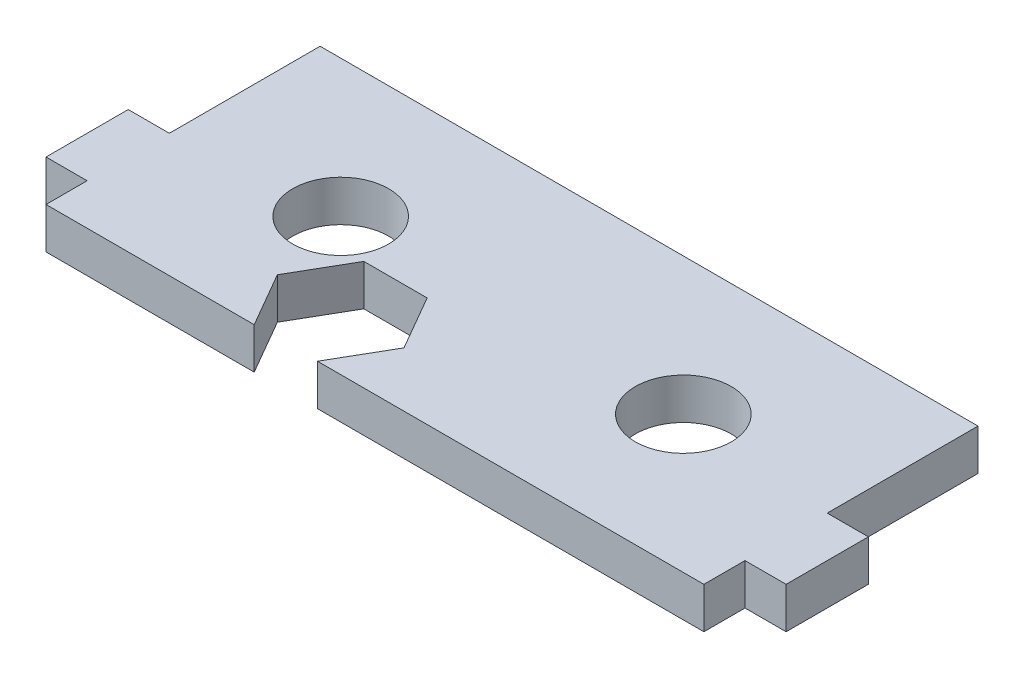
ISO-10303-21;
HEADER;
FILE_DESCRIPTION(('STEP AP214'),'2;1');
FILE_NAME('part.step','',(''),(''),'','','');
FILE_SCHEMA(('AUTOMOTIVE_DESIGN { 1 0 10303 214 1 1 1 1 }'));
ENDSEC;
DATA;
#1=APPLICATION_CONTEXT('core data for automotive mechanical design processes');
#2=APPLICATION_PROTOCOL_DEFINITION('international standard','automotive_design',2000,#1);
#3=PRODUCT_CONTEXT('',#1,'mechanical');
#4=PRODUCT('Part','Part','',(#3));
#5=PRODUCT_RELATED_PRODUCT_CATEGORY('part','',(#4));
#6=PRODUCT_DEFINITION_FORMATION('','',#4);
#7=PRODUCT_DEFINITION_CONTEXT('part definition',#1,'design');
#8=PRODUCT_DEFINITION('design','',#6,#7);
#9=PRODUCT_DEFINITION_SHAPE('','',#8);
#10=(LENGTH_UNIT() NAMED_UNIT(*) SI_UNIT(.MILLI.,.METRE.));
#11=(NAMED_UNIT(*) PLANE_ANGLE_UNIT() SI_UNIT($,.RADIAN.));
#12=(NAMED_UNIT(*) SI_UNIT($,.STERADIAN.) SOLID_ANGLE_UNIT());
#13=UNCERTAINTY_MEASURE_WITH_UNIT(LENGTH_MEASURE(1.E-05),#10,'distance_accuracy_value','');
#14=(GEOMETRIC_REPRESENTATION_CONTEXT(3) GLOBAL_UNCERTAINTY_ASSIGNED_CONTEXT((#13)) GLOBAL_UNIT_ASSIGNED_CONTEXT((#10,
#11,#12)) REPRESENTATION_CONTEXT('',''));
#15=CARTESIAN_POINT('',(0.,0.,0.));
#16=DIRECTION('',(0.,0.,1.));
#17=DIRECTION('',(1.,0.,0.));
#18=AXIS2_PLACEMENT_3D('',#15,#16,#17);
#19=CARTESIAN_POINT('',(24.,3.,10.));
#20=DIRECTION('',(0.,1.,0.));
#21=DIRECTION('',(0.,0.,1.));
#22=AXIS2_PLACEMENT_3D('',#19,#20,#21);
#23=PLANE('',#22);
#24=CARTESIAN_POINT('',(-12.5,3.,0.));
#25=DIRECTION('',(0.,1.,0.));
#26=DIRECTION('',(0.,0.,1.));
#27=AXIS2_PLACEMENT_3D('',#24,#25,#26);
#28=CIRCLE('',#27,3.5);
#29=CARTESIAN_POINT('',(-12.5,3.,3.5));
#30=VERTEX_POINT('',#29);
#31=EDGE_CURVE('E194',#30,#30,#28,.T.);
#32=ORIENTED_EDGE('',*,*,#31,.F.);
#33=EDGE_LOOP('',(#32));
#34=FACE_BOUND('',#33,.T.);
#35=DIRECTION('',(1.,0.,0.));
#36=VECTOR('',#35,1.);
#37=CARTESIAN_POINT('',(-24.,3.,10.));
#38=LINE('',#37,#36);
#39=CARTESIAN_POINT('',(-24.,3.,10.));
#40=VERTEX_POINT('',#39);
#41=CARTESIAN_POINT('',(-8.80940107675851,3.,10.));
#42=VERTEX_POINT('',#41);
#43=EDGE_CURVE('E279',#40,#42,#38,.T.);
#44=ORIENTED_EDGE('',*,*,#43,.T.);
#45=DIRECTION('',(0.5,0.,0.866025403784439));
#46=VECTOR('',#45,1.);
#47=CARTESIAN_POINT('',(-11.118802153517,3.,6.));
#48=LINE('',#47,#46);
#49=CARTESIAN_POINT('',(-11.118802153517,3.,6.));
#50=VERTEX_POINT('',#49);
#51=EDGE_CURVE('E186',#50,#42,#48,.T.);
#52=ORIENTED_EDGE('',*,*,#51,.F.);
#53=DIRECTION('',(-0.5,0.,0.866025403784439));
#54=VECTOR('',#53,1.);
#55=CARTESIAN_POINT('',(-8.80940107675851,3.,1.99999999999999));
#56=LINE('',#55,#54);
#57=CARTESIAN_POINT('',(-8.80940107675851,3.,1.99999999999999));
#58=VERTEX_POINT('',#57);
#59=EDGE_CURVE('E184',#58,#50,#56,.T.);
#60=ORIENTED_EDGE('',*,*,#59,.F.);
#61=DIRECTION('',(-1.,0.,0.));
#62=VECTOR('',#61,1.);
#63=CARTESIAN_POINT('',(-4.19059892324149,3.,1.99999999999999));
#64=LINE('',#63,#62);
#65=CARTESIAN_POINT('',(-4.19059892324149,3.,1.99999999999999));
#66=VERTEX_POINT('',#65);
#67=EDGE_CURVE('E170',#66,#58,#64,.T.);
#68=ORIENTED_EDGE('',*,*,#67,.F.);
#69=DIRECTION('',(-0.5,0.,-0.866025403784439));
#70=VECTOR('',#69,1.);
#71=CARTESIAN_POINT('',(-1.88119784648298,3.,6.));
#72=LINE('',#71,#70);
#73=CARTESIAN_POINT('',(-1.88119784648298,3.,6.));
#74=VERTEX_POINT('',#73);
#75=EDGE_CURVE('E162',#74,#66,#72,.T.);
#76=ORIENTED_EDGE('',*,*,#75,.F.);
#77=DIRECTION('',(0.5,0.,-0.866025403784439));
#78=VECTOR('',#77,1.);
#79=CARTESIAN_POINT('',(-4.19059892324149,3.,10.));
#80=LINE('',#79,#78);
#81=CARTESIAN_POINT('',(-4.19059892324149,3.,10.));
#82=VERTEX_POINT('',#81);
#83=EDGE_CURVE('E191',#82,#74,#80,.T.);
#84=ORIENTED_EDGE('',*,*,#83,.F.);
#85=CARTESIAN_POINT('',(24.,3.,10.));
#86=VERTEX_POINT('',#85);
#87=EDGE_CURVE('E292',#82,#86,#38,.T.);
#88=ORIENTED_EDGE('',*,*,#87,.T.);
#89=DIRECTION('',(0.,0.,-1.));
#90=VECTOR('',#89,1.);
#91=CARTESIAN_POINT('',(24.,3.,-9.99999999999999));
#92=LINE('',#91,#90);
#93=CARTESIAN_POINT('',(24.,3.,7.00000000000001));
#94=VERTEX_POINT('',#93);
#95=EDGE_CURVE('E259',#86,#94,#92,.T.);
#96=ORIENTED_EDGE('',*,*,#95,.T.);
#97=DIRECTION('',(1.,0.,0.));
#98=VECTOR('',#97,1.);
#99=CARTESIAN_POINT('',(27.,3.,7.00000000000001));
#100=LINE('',#99,#98);
#101=CARTESIAN_POINT('',(27.,3.,7.00000000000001));
#102=VERTEX_POINT('',#101);
#103=EDGE_CURVE('E216',#94,#102,#100,.T.);
#104=ORIENTED_EDGE('',*,*,#103,.T.);
#105=DIRECTION('',(0.,0.,-1.));
#106=VECTOR('',#105,1.);
#107=CARTESIAN_POINT('',(27.,3.,1.00000000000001));
#108=LINE('',#107,#106);
#109=CARTESIAN_POINT('',(27.,3.,1.00000000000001));
#110=VERTEX_POINT('',#109);
#111=EDGE_CURVE('E213',#102,#110,#108,.T.);
#112=ORIENTED_EDGE('',*,*,#111,.T.);
#113=DIRECTION('',(-1.,0.,0.));
#114=VECTOR('',#113,1.);
#115=CARTESIAN_POINT('',(27.,3.,1.00000000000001));
#116=LINE('',#115,#114);
#117=CARTESIAN_POINT('',(24.,3.,1.00000000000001));
#118=VERTEX_POINT('',#117);
#119=EDGE_CURVE('E219',#110,#118,#116,.T.);
#120=ORIENTED_EDGE('',*,*,#119,.T.);
#121=CARTESIAN_POINT('',(24.,3.,-9.99999999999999));
#122=VERTEX_POINT('',#121);
#123=EDGE_CURVE('E244',#118,#122,#92,.T.);
#124=ORIENTED_EDGE('',*,*,#123,.T.);
#125=DIRECTION('',(-1.,0.,0.));
#126=VECTOR('',#125,1.);
#127=CARTESIAN_POINT('',(-24.,3.,-9.99999999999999));
#128=LINE('',#127,#126);
#129=CARTESIAN_POINT('',(-24.,3.,-9.99999999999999));
#130=VERTEX_POINT('',#129);
#131=EDGE_CURVE('E262',#122,#130,#128,.T.);
#132=ORIENTED_EDGE('',*,*,#131,.T.);
#133=DIRECTION('',(0.,0.,1.));
#134=VECTOR('',#133,1.);
#135=CARTESIAN_POINT('',(-24.,3.,-9.99999999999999));
#136=LINE('',#135,#134);
#137=CARTESIAN_POINT('',(-24.,3.,1.00000000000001));
#138=VERTEX_POINT('',#137);
#139=EDGE_CURVE('E288',#130,#138,#136,.T.);
#140=ORIENTED_EDGE('',*,*,#139,.T.);
#141=DIRECTION('',(-1.,0.,0.));
#142=VECTOR('',#141,1.);
#143=CARTESIAN_POINT('',(-27.,3.,1.00000000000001));
#144=LINE('',#143,#142);
#145=CARTESIAN_POINT('',(-27.,3.,1.00000000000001));
#146=VERTEX_POINT('',#145);
#147=EDGE_CURVE('E336',#138,#146,#144,.T.);
#148=ORIENTED_EDGE('',*,*,#147,.T.);
#149=DIRECTION('',(0.,0.,1.));
#150=VECTOR('',#149,1.);
#151=CARTESIAN_POINT('',(-27.,3.,1.00000000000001));
#152=LINE('',#151,#150);
#153=CARTESIAN_POINT('',(-27.,3.,7.00000000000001));
#154=VERTEX_POINT('',#153);
#155=EDGE_CURVE('E340',#146,#154,#152,.T.);
#156=ORIENTED_EDGE('',*,*,#155,.T.);
#157=DIRECTION('',(1.,0.,0.));
#158=VECTOR('',#157,1.);
#159=CARTESIAN_POINT('',(-27.,3.,7.00000000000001));
#160=LINE('',#159,#158);
#161=CARTESIAN_POINT('',(-24.,3.,7.00000000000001));
#162=VERTEX_POINT('',#161);
#163=EDGE_CURVE('E333',#154,#162,#160,.T.);
#164=ORIENTED_EDGE('',*,*,#163,.T.);
#165=EDGE_CURVE('E293',#162,#40,#136,.T.);
#166=ORIENTED_EDGE('',*,*,#165,.T.);
#167=EDGE_LOOP('',(#44,#52,#60,#68,#76,#84,#88,#96,#104,#112,#120,#124,#132,#140,#148,#156,#164,#166));
#168=FACE_BOUND('',#167,.T.);
#169=CARTESIAN_POINT('',(12.5,3.,0.));
#170=DIRECTION('',(0.,1.,0.));
#171=DIRECTION('',(0.,0.,1.));
#172=AXIS2_PLACEMENT_3D('',#169,#170,#171);
#173=CIRCLE('',#172,3.5);
#174=CARTESIAN_POINT('',(12.5,3.,3.5));
#175=VERTEX_POINT('',#174);
#176=EDGE_CURVE('E588',#175,#175,#173,.T.);
#177=ORIENTED_EDGE('',*,*,#176,.F.);
#178=EDGE_LOOP('',(#177));
#179=FACE_BOUND('',#178,.T.);
#180=ADVANCED_FACE('F33',(#34,#168,#179),#23,.T.);
#181=CARTESIAN_POINT('',(24.,0.,10.));
#182=DIRECTION('',(0.,1.,0.));
#183=DIRECTION('',(0.,0.,1.));
#184=AXIS2_PLACEMENT_3D('',#181,#182,#183);
#185=PLANE('',#184);
#186=CARTESIAN_POINT('',(-12.5,0.,0.));
#187=DIRECTION('',(0.,1.,0.));
#188=DIRECTION('',(0.,0.,1.));
#189=AXIS2_PLACEMENT_3D('',#186,#187,#188);
#190=CIRCLE('',#189,3.5);
#191=CARTESIAN_POINT('',(-12.5,0.,3.5));
#192=VERTEX_POINT('',#191);
#193=EDGE_CURVE('E593',#192,#192,#190,.T.);
#194=ORIENTED_EDGE('',*,*,#193,.T.);
#195=EDGE_LOOP('',(#194));
#196=FACE_BOUND('',#195,.T.);
#197=DIRECTION('',(0.5,0.,0.866025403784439));
#198=VECTOR('',#197,1.);
#199=CARTESIAN_POINT('',(-11.118802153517,0.,6.));
#200=LINE('',#199,#198);
#201=CARTESIAN_POINT('',(-11.118802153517,0.,6.));
#202=VERTEX_POINT('',#201);
#203=CARTESIAN_POINT('',(-8.80940107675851,0.,10.));
#204=VERTEX_POINT('',#203);
#205=EDGE_CURVE('E199',#202,#204,#200,.T.);
#206=ORIENTED_EDGE('',*,*,#205,.T.);
#207=DIRECTION('',(1.,0.,0.));
#208=VECTOR('',#207,1.);
#209=CARTESIAN_POINT('',(-24.,0.,10.));
#210=LINE('',#209,#208);
#211=CARTESIAN_POINT('',(-24.,0.,10.));
#212=VERTEX_POINT('',#211);
#213=EDGE_CURVE('E260',#212,#204,#210,.T.);
#214=ORIENTED_EDGE('',*,*,#213,.F.);
#215=DIRECTION('',(0.,0.,1.));
#216=VECTOR('',#215,1.);
#217=CARTESIAN_POINT('',(-24.,0.,-9.99999999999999));
#218=LINE('',#217,#216);
#219=CARTESIAN_POINT('',(-24.,0.,7.00000000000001));
#220=VERTEX_POINT('',#219);
#221=EDGE_CURVE('E285',#220,#212,#218,.T.);
#222=ORIENTED_EDGE('',*,*,#221,.F.);
#223=DIRECTION('',(1.,0.,0.));
#224=VECTOR('',#223,1.);
#225=CARTESIAN_POINT('',(-27.,0.,7.00000000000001));
#226=LINE('',#225,#224);
#227=CARTESIAN_POINT('',(-27.,0.,7.00000000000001));
#228=VERTEX_POINT('',#227);
#229=EDGE_CURVE('E334',#228,#220,#226,.T.);
#230=ORIENTED_EDGE('',*,*,#229,.F.);
#231=DIRECTION('',(0.,0.,1.));
#232=VECTOR('',#231,1.);
#233=CARTESIAN_POINT('',(-27.,0.,1.00000000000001));
#234=LINE('',#233,#232);
#235=CARTESIAN_POINT('',(-27.,0.,1.00000000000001));
#236=VERTEX_POINT('',#235);
#237=EDGE_CURVE('E311',#236,#228,#234,.T.);
#238=ORIENTED_EDGE('',*,*,#237,.F.);
#239=DIRECTION('',(-1.,0.,0.));
#240=VECTOR('',#239,1.);
#241=CARTESIAN_POINT('',(-27.,0.,1.00000000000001));
#242=LINE('',#241,#240);
#243=CARTESIAN_POINT('',(-24.,0.,1.00000000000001));
#244=VERTEX_POINT('',#243);
#245=EDGE_CURVE('E249',#244,#236,#242,.T.);
#246=ORIENTED_EDGE('',*,*,#245,.F.);
#247=CARTESIAN_POINT('',(-24.,0.,-9.99999999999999));
#248=VERTEX_POINT('',#247);
#249=EDGE_CURVE('E270',#248,#244,#218,.T.);
#250=ORIENTED_EDGE('',*,*,#249,.F.);
#251=DIRECTION('',(-1.,0.,0.));
#252=VECTOR('',#251,1.);
#253=CARTESIAN_POINT('',(-24.,0.,-9.99999999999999));
#254=LINE('',#253,#252);
#255=CARTESIAN_POINT('',(24.,0.,-9.99999999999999));
#256=VERTEX_POINT('',#255);
#257=EDGE_CURVE('E287',#256,#248,#254,.T.);
#258=ORIENTED_EDGE('',*,*,#257,.F.);
#259=DIRECTION('',(0.,0.,-1.));
#260=VECTOR('',#259,1.);
#261=CARTESIAN_POINT('',(24.,0.,-9.99999999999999));
#262=LINE('',#261,#260);
#263=CARTESIAN_POINT('',(24.,0.,1.00000000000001));
#264=VERTEX_POINT('',#263);
#265=EDGE_CURVE('E303',#264,#256,#262,.T.);
#266=ORIENTED_EDGE('',*,*,#265,.F.);
#267=DIRECTION('',(-1.,0.,0.));
#268=VECTOR('',#267,1.);
#269=CARTESIAN_POINT('',(27.,0.,1.00000000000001));
#270=LINE('',#269,#268);
#271=CARTESIAN_POINT('',(27.,0.,1.00000000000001));
#272=VERTEX_POINT('',#271);
#273=EDGE_CURVE('E58',#272,#264,#270,.T.);
#274=ORIENTED_EDGE('',*,*,#273,.F.);
#275=DIRECTION('',(0.,0.,-1.));
#276=VECTOR('',#275,1.);
#277=CARTESIAN_POINT('',(27.,0.,1.00000000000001));
#278=LINE('',#277,#276);
#279=CARTESIAN_POINT('',(27.,0.,7.00000000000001));
#280=VERTEX_POINT('',#279);
#281=EDGE_CURVE('E217',#280,#272,#278,.T.);
#282=ORIENTED_EDGE('',*,*,#281,.F.);
#283=DIRECTION('',(1.,0.,0.));
#284=VECTOR('',#283,1.);
#285=CARTESIAN_POINT('',(27.,0.,7.00000000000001));
#286=LINE('',#285,#284);
#287=CARTESIAN_POINT('',(24.,0.,7.00000000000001));
#288=VERTEX_POINT('',#287);
#289=EDGE_CURVE('E220',#288,#280,#286,.T.);
#290=ORIENTED_EDGE('',*,*,#289,.F.);
#291=CARTESIAN_POINT('',(24.,0.,10.));
#292=VERTEX_POINT('',#291);
#293=EDGE_CURVE('E305',#292,#288,#262,.T.);
#294=ORIENTED_EDGE('',*,*,#293,.F.);
#295=CARTESIAN_POINT('',(-4.19059892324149,0.,10.));
#296=VERTEX_POINT('',#295);
#297=EDGE_CURVE('E264',#296,#292,#210,.T.);
#298=ORIENTED_EDGE('',*,*,#297,.F.);
#299=DIRECTION('',(0.5,0.,-0.866025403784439));
#300=VECTOR('',#299,1.);
#301=CARTESIAN_POINT('',(-4.19059892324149,0.,10.));
#302=LINE('',#301,#300);
#303=CARTESIAN_POINT('',(-1.88119784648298,0.,6.));
#304=VERTEX_POINT('',#303);
#305=EDGE_CURVE('E171',#296,#304,#302,.T.);
#306=ORIENTED_EDGE('',*,*,#305,.T.);
#307=DIRECTION('',(-0.5,0.,-0.866025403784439));
#308=VECTOR('',#307,1.);
#309=CARTESIAN_POINT('',(-1.88119784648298,0.,6.));
#310=LINE('',#309,#308);
#311=CARTESIAN_POINT('',(-4.19059892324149,0.,1.99999999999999));
#312=VERTEX_POINT('',#311);
#313=EDGE_CURVE('E50',#304,#312,#310,.T.);
#314=ORIENTED_EDGE('',*,*,#313,.T.);
#315=DIRECTION('',(-1.,0.,0.));
#316=VECTOR('',#315,1.);
#317=CARTESIAN_POINT('',(-4.19059892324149,0.,1.99999999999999));
#318=LINE('',#317,#316);
#319=CARTESIAN_POINT('',(-8.80940107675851,0.,1.99999999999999));
#320=VERTEX_POINT('',#319);
#321=EDGE_CURVE('E177',#312,#320,#318,.T.);
#322=ORIENTED_EDGE('',*,*,#321,.T.);
#323=DIRECTION('',(-0.5,0.,0.866025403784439));
#324=VECTOR('',#323,1.);
#325=CARTESIAN_POINT('',(-8.80940107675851,0.,1.99999999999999));
#326=LINE('',#325,#324);
#327=EDGE_CURVE('E196',#320,#202,#326,.T.);
#328=ORIENTED_EDGE('',*,*,#327,.T.);
#329=EDGE_LOOP('',(#206,#214,#222,#230,#238,#246,#250,#258,#266,#274,#282,#290,#294,#298,#306,
#314,#322,#328));
#330=FACE_BOUND('',#329,.T.);
#331=CARTESIAN_POINT('',(12.5,0.,0.));
#332=DIRECTION('',(0.,1.,0.));
#333=DIRECTION('',(0.,0.,1.));
#334=AXIS2_PLACEMENT_3D('',#331,#332,#333);
#335=CIRCLE('',#334,3.5);
#336=CARTESIAN_POINT('',(12.5,0.,3.5));
#337=VERTEX_POINT('',#336);
#338=EDGE_CURVE('E591',#337,#337,#335,.T.);
#339=ORIENTED_EDGE('',*,*,#338,.T.);
#340=EDGE_LOOP('',(#339));
#341=FACE_BOUND('',#340,.T.);
#342=ADVANCED_FACE('F371',(#196,#330,#341),#185,.F.);
#343=CARTESIAN_POINT('',(-24.,3.,10.));
#344=DIRECTION('',(0.,0.,-1.));
#345=DIRECTION('',(-1.,0.,0.));
#346=AXIS2_PLACEMENT_3D('',#343,#344,#345);
#347=PLANE('',#346);
#348=DIRECTION('',(0.,-1.,0.));
#349=VECTOR('',#348,1.);
#350=CARTESIAN_POINT('',(-8.80940107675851,3.,10.));
#351=LINE('',#350,#349);
#352=EDGE_CURVE('E208',#42,#204,#351,.T.);
#353=ORIENTED_EDGE('',*,*,#352,.F.);
#354=ORIENTED_EDGE('',*,*,#43,.F.);
#355=DIRECTION('',(0.,-1.,0.));
#356=VECTOR('',#355,1.);
#357=CARTESIAN_POINT('',(-24.,3.,10.));
#358=LINE('',#357,#356);
#359=EDGE_CURVE('E278',#40,#212,#358,.T.);
#360=ORIENTED_EDGE('',*,*,#359,.T.);
#361=ORIENTED_EDGE('',*,*,#213,.T.);
#362=EDGE_LOOP('',(#353,#354,#360,#361));
#363=FACE_BOUND('',#362,.T.);
#364=ADVANCED_FACE('F373',(#363),#347,.F.);
#365=DIRECTION('',(0.,-1.,0.));
#366=VECTOR('',#365,1.);
#367=CARTESIAN_POINT('',(-4.19059892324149,3.,10.));
#368=LINE('',#367,#366);
#369=EDGE_CURVE('E205',#82,#296,#368,.T.);
#370=ORIENTED_EDGE('',*,*,#369,.T.);
#371=ORIENTED_EDGE('',*,*,#297,.T.);
#372=DIRECTION('',(0.,-1.,0.));
#373=VECTOR('',#372,1.);
#374=CARTESIAN_POINT('',(24.,3.,10.));
#375=LINE('',#374,#373);
#376=EDGE_CURVE('E275',#86,#292,#375,.T.);
#377=ORIENTED_EDGE('',*,*,#376,.F.);
#378=ORIENTED_EDGE('',*,*,#87,.F.);
#379=EDGE_LOOP('',(#370,#371,#377,#378));
#380=FACE_BOUND('',#379,.T.);
#381=ADVANCED_FACE('F387',(#380),#347,.F.);
#382=CARTESIAN_POINT('',(24.,3.,-9.99999999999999));
#383=DIRECTION('',(-1.,0.,0.));
#384=DIRECTION('',(0.,0.,1.));
#385=AXIS2_PLACEMENT_3D('',#382,#383,#384);
#386=PLANE('',#385);
#387=DIRECTION('',(0.,-1.,0.));
#388=VECTOR('',#387,1.);
#389=CARTESIAN_POINT('',(24.,3.,7.00000000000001));
#390=LINE('',#389,#388);
#391=EDGE_CURVE('E225',#94,#288,#390,.T.);
#392=ORIENTED_EDGE('',*,*,#391,.F.);
#393=ORIENTED_EDGE('',*,*,#95,.F.);
#394=ORIENTED_EDGE('',*,*,#376,.T.);
#395=ORIENTED_EDGE('',*,*,#293,.T.);
#396=EDGE_LOOP('',(#392,#393,#394,#395));
#397=FACE_BOUND('',#396,.T.);
#398=ADVANCED_FACE('F392',(#397),#386,.F.);
#399=CARTESIAN_POINT('',(-24.,3.,-9.99999999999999));
#400=DIRECTION('',(1.,0.,0.));
#401=DIRECTION('',(0.,0.,-1.));
#402=AXIS2_PLACEMENT_3D('',#399,#400,#401);
#403=PLANE('',#402);
#404=DIRECTION('',(0.,-1.,0.));
#405=VECTOR('',#404,1.);
#406=CARTESIAN_POINT('',(-24.,3.,1.00000000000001));
#407=LINE('',#406,#405);
#408=EDGE_CURVE('E312',#138,#244,#407,.T.);
#409=ORIENTED_EDGE('',*,*,#408,.F.);
#410=ORIENTED_EDGE('',*,*,#139,.F.);
#411=DIRECTION('',(0.,-1.,0.));
#412=VECTOR('',#411,1.);
#413=CARTESIAN_POINT('',(-24.,3.,-9.99999999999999));
#414=LINE('',#413,#412);
#415=EDGE_CURVE('E42',#130,#248,#414,.T.);
#416=ORIENTED_EDGE('',*,*,#415,.T.);
#417=ORIENTED_EDGE('',*,*,#249,.T.);
#418=EDGE_LOOP('',(#409,#410,#416,#417));
#419=FACE_BOUND('',#418,.T.);
#420=ADVANCED_FACE('F367',(#419),#403,.F.);
#421=ORIENTED_EDGE('',*,*,#123,.F.);
#422=DIRECTION('',(0.,-1.,0.));
#423=VECTOR('',#422,1.);
#424=CARTESIAN_POINT('',(24.,3.,1.00000000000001));
#425=LINE('',#424,#423);
#426=EDGE_CURVE('E233',#118,#264,#425,.T.);
#427=ORIENTED_EDGE('',*,*,#426,.T.);
#428=ORIENTED_EDGE('',*,*,#265,.T.);
#429=DIRECTION('',(0.,-1.,0.));
#430=VECTOR('',#429,1.);
#431=CARTESIAN_POINT('',(24.,3.,-9.99999999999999));
#432=LINE('',#431,#430);
#433=EDGE_CURVE('E11',#122,#256,#432,.T.);
#434=ORIENTED_EDGE('',*,*,#433,.F.);
#435=EDGE_LOOP('',(#421,#427,#428,#434));
#436=FACE_BOUND('',#435,.T.);
#437=ADVANCED_FACE('F35',(#436),#386,.F.);
#438=CARTESIAN_POINT('',(-24.,3.,-9.99999999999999));
#439=DIRECTION('',(0.,0.,1.));
#440=DIRECTION('',(1.,0.,0.));
#441=AXIS2_PLACEMENT_3D('',#438,#439,#440);
#442=PLANE('',#441);
#443=ORIENTED_EDGE('',*,*,#257,.T.);
#444=ORIENTED_EDGE('',*,*,#415,.F.);
#445=ORIENTED_EDGE('',*,*,#131,.F.);
#446=ORIENTED_EDGE('',*,*,#433,.T.);
#447=EDGE_LOOP('',(#443,#444,#445,#446));
#448=FACE_BOUND('',#447,.T.);
#449=ADVANCED_FACE('F362',(#448),#442,.F.);
#450=ORIENTED_EDGE('',*,*,#165,.F.);
#451=DIRECTION('',(0.,-1.,0.));
#452=VECTOR('',#451,1.);
#453=CARTESIAN_POINT('',(-24.,3.,7.00000000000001));
#454=LINE('',#453,#452);
#455=EDGE_CURVE('E328',#162,#220,#454,.T.);
#456=ORIENTED_EDGE('',*,*,#455,.T.);
#457=ORIENTED_EDGE('',*,*,#221,.T.);
#458=ORIENTED_EDGE('',*,*,#359,.F.);
#459=EDGE_LOOP('',(#450,#456,#457,#458));
#460=FACE_BOUND('',#459,.T.);
#461=ADVANCED_FACE('F357',(#460),#403,.F.);
#462=CARTESIAN_POINT('',(-27.,3.,1.00000000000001));
#463=DIRECTION('',(0.,0.,1.));
#464=DIRECTION('',(1.,0.,0.));
#465=AXIS2_PLACEMENT_3D('',#462,#463,#464);
#466=PLANE('',#465);
#467=ORIENTED_EDGE('',*,*,#245,.T.);
#468=DIRECTION('',(0.,-1.,0.));
#469=VECTOR('',#468,1.);
#470=CARTESIAN_POINT('',(-27.,3.,1.00000000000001));
#471=LINE('',#470,#469);
#472=EDGE_CURVE('E316',#146,#236,#471,.T.);
#473=ORIENTED_EDGE('',*,*,#472,.F.);
#474=ORIENTED_EDGE('',*,*,#147,.F.);
#475=ORIENTED_EDGE('',*,*,#408,.T.);
#476=EDGE_LOOP('',(#467,#473,#474,#475));
#477=FACE_BOUND('',#476,.T.);
#478=ADVANCED_FACE('F369',(#477),#466,.F.);
#479=CARTESIAN_POINT('',(-27.,3.,1.00000000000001));
#480=DIRECTION('',(1.,0.,0.));
#481=DIRECTION('',(0.,0.,-1.));
#482=AXIS2_PLACEMENT_3D('',#479,#480,#481);
#483=PLANE('',#482);
#484=ORIENTED_EDGE('',*,*,#237,.T.);
#485=DIRECTION('',(0.,-1.,0.));
#486=VECTOR('',#485,1.);
#487=CARTESIAN_POINT('',(-27.,3.,7.00000000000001));
#488=LINE('',#487,#486);
#489=EDGE_CURVE('E325',#154,#228,#488,.T.);
#490=ORIENTED_EDGE('',*,*,#489,.F.);
#491=ORIENTED_EDGE('',*,*,#155,.F.);
#492=ORIENTED_EDGE('',*,*,#472,.T.);
#493=EDGE_LOOP('',(#484,#490,#491,#492));
#494=FACE_BOUND('',#493,.T.);
#495=ADVANCED_FACE('F348',(#494),#483,.F.);
#496=CARTESIAN_POINT('',(-27.,3.,7.00000000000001));
#497=DIRECTION('',(0.,0.,-1.));
#498=DIRECTION('',(-1.,0.,0.));
#499=AXIS2_PLACEMENT_3D('',#496,#497,#498);
#500=PLANE('',#499);
#501=ORIENTED_EDGE('',*,*,#229,.T.);
#502=ORIENTED_EDGE('',*,*,#455,.F.);
#503=ORIENTED_EDGE('',*,*,#163,.F.);
#504=ORIENTED_EDGE('',*,*,#489,.T.);
#505=EDGE_LOOP('',(#501,#502,#503,#504));
#506=FACE_BOUND('',#505,.T.);
#507=ADVANCED_FACE('F352',(#506),#500,.F.);
#508=CARTESIAN_POINT('',(27.,3.,1.00000000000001));
#509=DIRECTION('',(0.,0.,1.));
#510=DIRECTION('',(1.,0.,0.));
#511=AXIS2_PLACEMENT_3D('',#508,#509,#510);
#512=PLANE('',#511);
#513=ORIENTED_EDGE('',*,*,#273,.T.);
#514=ORIENTED_EDGE('',*,*,#426,.F.);
#515=ORIENTED_EDGE('',*,*,#119,.F.);
#516=DIRECTION('',(0.,-1.,0.));
#517=VECTOR('',#516,1.);
#518=CARTESIAN_POINT('',(27.,3.,1.00000000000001));
#519=LINE('',#518,#517);
#520=EDGE_CURVE('E215',#110,#272,#519,.T.);
#521=ORIENTED_EDGE('',*,*,#520,.T.);
#522=EDGE_LOOP('',(#513,#514,#515,#521));
#523=FACE_BOUND('',#522,.T.);
#524=ADVANCED_FACE('F255',(#523),#512,.F.);
#525=CARTESIAN_POINT('',(27.,3.,7.00000000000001));
#526=DIRECTION('',(0.,0.,-1.));
#527=DIRECTION('',(-1.,0.,0.));
#528=AXIS2_PLACEMENT_3D('',#525,#526,#527);
#529=PLANE('',#528);
#530=ORIENTED_EDGE('',*,*,#289,.T.);
#531=DIRECTION('',(0.,-1.,0.));
#532=VECTOR('',#531,1.);
#533=CARTESIAN_POINT('',(27.,3.,7.00000000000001));
#534=LINE('',#533,#532);
#535=EDGE_CURVE('E222',#102,#280,#534,.T.);
#536=ORIENTED_EDGE('',*,*,#535,.F.);
#537=ORIENTED_EDGE('',*,*,#103,.F.);
#538=ORIENTED_EDGE('',*,*,#391,.T.);
#539=EDGE_LOOP('',(#530,#536,#537,#538));
#540=FACE_BOUND('',#539,.T.);
#541=ADVANCED_FACE('F393',(#540),#529,.F.);
#542=CARTESIAN_POINT('',(27.,3.,1.00000000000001));
#543=DIRECTION('',(-1.,0.,0.));
#544=DIRECTION('',(0.,0.,1.));
#545=AXIS2_PLACEMENT_3D('',#542,#543,#544);
#546=PLANE('',#545);
#547=ORIENTED_EDGE('',*,*,#281,.T.);
#548=ORIENTED_EDGE('',*,*,#520,.F.);
#549=ORIENTED_EDGE('',*,*,#111,.F.);
#550=ORIENTED_EDGE('',*,*,#535,.T.);
#551=EDGE_LOOP('',(#547,#548,#549,#550));
#552=FACE_BOUND('',#551,.T.);
#553=ADVANCED_FACE('F396',(#552),#546,.F.);
#554=CARTESIAN_POINT('',(-1.88119784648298,3.,6.));
#555=DIRECTION('',(-0.866025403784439,0.,0.5));
#556=DIRECTION('',(0.5,0.,0.866025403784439));
#557=AXIS2_PLACEMENT_3D('',#554,#555,#556);
#558=PLANE('',#557);
#559=ORIENTED_EDGE('',*,*,#313,.F.);
#560=DIRECTION('',(0.,-1.,0.));
#561=VECTOR('',#560,1.);
#562=CARTESIAN_POINT('',(-1.88119784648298,3.,6.));
#563=LINE('',#562,#561);
#564=EDGE_CURVE('E166',#74,#304,#563,.T.);
#565=ORIENTED_EDGE('',*,*,#564,.F.);
#566=ORIENTED_EDGE('',*,*,#75,.T.);
#567=DIRECTION('',(0.,-1.,0.));
#568=VECTOR('',#567,1.);
#569=CARTESIAN_POINT('',(-4.19059892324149,3.,1.99999999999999));
#570=LINE('',#569,#568);
#571=EDGE_CURVE('E165',#66,#312,#570,.T.);
#572=ORIENTED_EDGE('',*,*,#571,.T.);
#573=EDGE_LOOP('',(#559,#565,#566,#572));
#574=FACE_BOUND('',#573,.T.);
#575=ADVANCED_FACE('F164',(#574),#558,.T.);
#576=CARTESIAN_POINT('',(-4.19059892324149,3.,1.99999999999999));
#577=DIRECTION('',(0.,0.,1.));
#578=DIRECTION('',(1.,0.,0.));
#579=AXIS2_PLACEMENT_3D('',#576,#577,#578);
#580=PLANE('',#579);
#581=ORIENTED_EDGE('',*,*,#321,.F.);
#582=ORIENTED_EDGE('',*,*,#571,.F.);
#583=ORIENTED_EDGE('',*,*,#67,.T.);
#584=DIRECTION('',(0.,-1.,0.));
#585=VECTOR('',#584,1.);
#586=CARTESIAN_POINT('',(-8.80940107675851,3.,1.99999999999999));
#587=LINE('',#586,#585);
#588=EDGE_CURVE('E178',#58,#320,#587,.T.);
#589=ORIENTED_EDGE('',*,*,#588,.T.);
#590=EDGE_LOOP('',(#581,#582,#583,#589));
#591=FACE_BOUND('',#590,.T.);
#592=ADVANCED_FACE('F174',(#591),#580,.T.);
#593=CARTESIAN_POINT('',(-8.80940107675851,3.,1.99999999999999));
#594=DIRECTION('',(0.866025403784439,0.,0.5));
#595=DIRECTION('',(0.5,0.,-0.866025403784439));
#596=AXIS2_PLACEMENT_3D('',#593,#594,#595);
#597=PLANE('',#596);
#598=ORIENTED_EDGE('',*,*,#327,.F.);
#599=ORIENTED_EDGE('',*,*,#588,.F.);
#600=ORIENTED_EDGE('',*,*,#59,.T.);
#601=DIRECTION('',(0.,-1.,0.));
#602=VECTOR('',#601,1.);
#603=CARTESIAN_POINT('',(-11.118802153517,3.,6.));
#604=LINE('',#603,#602);
#605=EDGE_CURVE('E210',#50,#202,#604,.T.);
#606=ORIENTED_EDGE('',*,*,#605,.T.);
#607=EDGE_LOOP('',(#598,#599,#600,#606));
#608=FACE_BOUND('',#607,.T.);
#609=ADVANCED_FACE('F380',(#608),#597,.T.);
#610=CARTESIAN_POINT('',(-11.118802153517,3.,6.));
#611=DIRECTION('',(0.866025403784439,0.,-0.5));
#612=DIRECTION('',(-0.5,0.,-0.866025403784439));
#613=AXIS2_PLACEMENT_3D('',#610,#611,#612);
#614=PLANE('',#613);
#615=ORIENTED_EDGE('',*,*,#205,.F.);
#616=ORIENTED_EDGE('',*,*,#605,.F.);
#617=ORIENTED_EDGE('',*,*,#51,.T.);
#618=ORIENTED_EDGE('',*,*,#352,.T.);
#619=EDGE_LOOP('',(#615,#616,#617,#618));
#620=FACE_BOUND('',#619,.T.);
#621=ADVANCED_FACE('F377',(#620),#614,.T.);
#622=CARTESIAN_POINT('',(-4.19059892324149,3.,10.));
#623=DIRECTION('',(-0.866025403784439,0.,-0.5));
#624=DIRECTION('',(-0.5,0.,0.866025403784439));
#625=AXIS2_PLACEMENT_3D('',#622,#623,#624);
#626=PLANE('',#625);
#627=ORIENTED_EDGE('',*,*,#305,.F.);
#628=ORIENTED_EDGE('',*,*,#369,.F.);
#629=ORIENTED_EDGE('',*,*,#83,.T.);
#630=ORIENTED_EDGE('',*,*,#564,.T.);
#631=EDGE_LOOP('',(#627,#628,#629,#630));
#632=FACE_BOUND('',#631,.T.);
#633=ADVANCED_FACE('F384',(#632),#626,.T.);
#634=CARTESIAN_POINT('',(-12.5,3.,0.));
#635=DIRECTION('',(0.,-1.,0.));
#636=DIRECTION('',(0.,0.,-1.));
#637=AXIS2_PLACEMENT_3D('',#634,#635,#636);
#638=CYLINDRICAL_SURFACE('',#637,3.5);
#639=ORIENTED_EDGE('',*,*,#31,.T.);
#640=EDGE_LOOP('',(#639));
#641=FACE_BOUND('',#640,.T.);
#642=ORIENTED_EDGE('',*,*,#193,.F.);
#643=EDGE_LOOP('',(#642));
#644=FACE_BOUND('',#643,.T.);
#645=ADVANCED_FACE('F559',(#641,#644),#638,.F.);
#646=CARTESIAN_POINT('',(12.5,3.,0.));
#647=DIRECTION('',(0.,-1.,0.));
#648=DIRECTION('',(0.,0.,-1.));
#649=AXIS2_PLACEMENT_3D('',#646,#647,#648);
#650=CYLINDRICAL_SURFACE('',#649,3.5);
#651=ORIENTED_EDGE('',*,*,#176,.T.);
#652=EDGE_LOOP('',(#651));
#653=FACE_BOUND('',#652,.T.);
#654=ORIENTED_EDGE('',*,*,#338,.F.);
#655=EDGE_LOOP('',(#654));
#656=FACE_BOUND('',#655,.T.);
#657=ADVANCED_FACE('F567',(#653,#656),#650,.F.);
#658=CLOSED_SHELL('',(#180,#342,#364,#381,#398,#420,#437,#449,#461,#478,#495,#507,#524,#541,
#553,#575,#592,#609,#621,#633,#645,#657));
#659=MANIFOLD_SOLID_BREP('B2',#658);
#660=ADVANCED_BREP_SHAPE_REPRESENTATION('',(#18,#659),#14);
#661=SHAPE_DEFINITION_REPRESENTATION(#9,#660);
ENDSEC;
END-ISO-10303-21;
